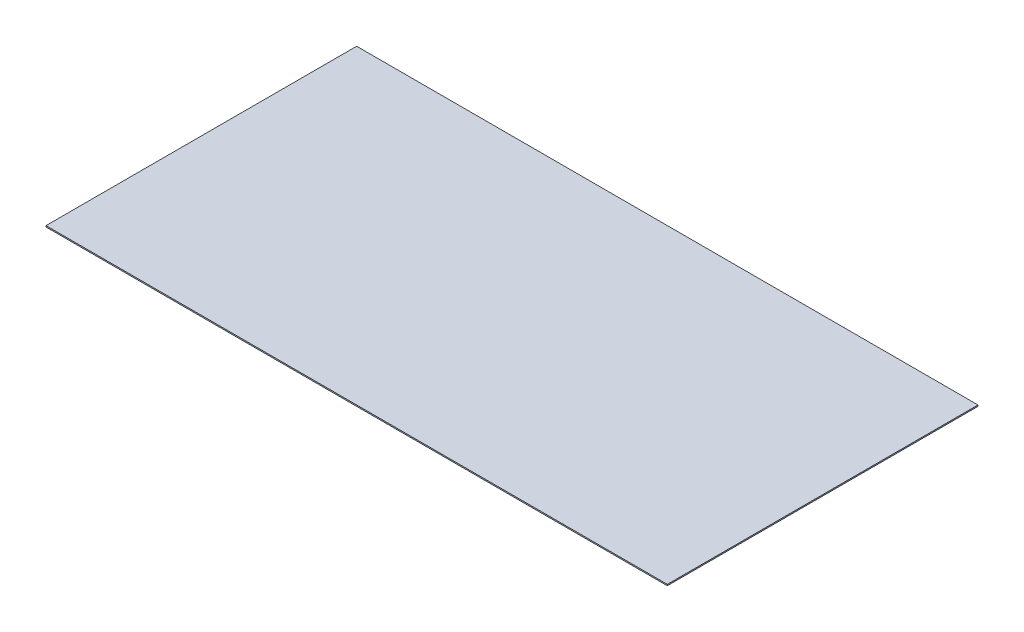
from build123d import *

# Parameters (mm, degrees)
BOSS_EXTRU_1_DEPTH      = 10000
BOSS_EXTRU_1_DEPTH_BACK = 40000
ESQUISSE1_W             = 100000
ESQUISSE1_H             = 200


with BuildPart() as part:
    # Esquisse1 → Boss.-Extru.1 (new, two sides: drawn at the far end of the back side and taken through both)
    with BuildSketch(Plane.XY.offset(-BOSS_EXTRU_1_DEPTH_BACK)):
        with Locations((50000, -100)):
            Rectangle(ESQUISSE1_W, ESQUISSE1_H)
    extrude(amount=BOSS_EXTRU_1_DEPTH + BOSS_EXTRU_1_DEPTH_BACK)


solid = part.part
